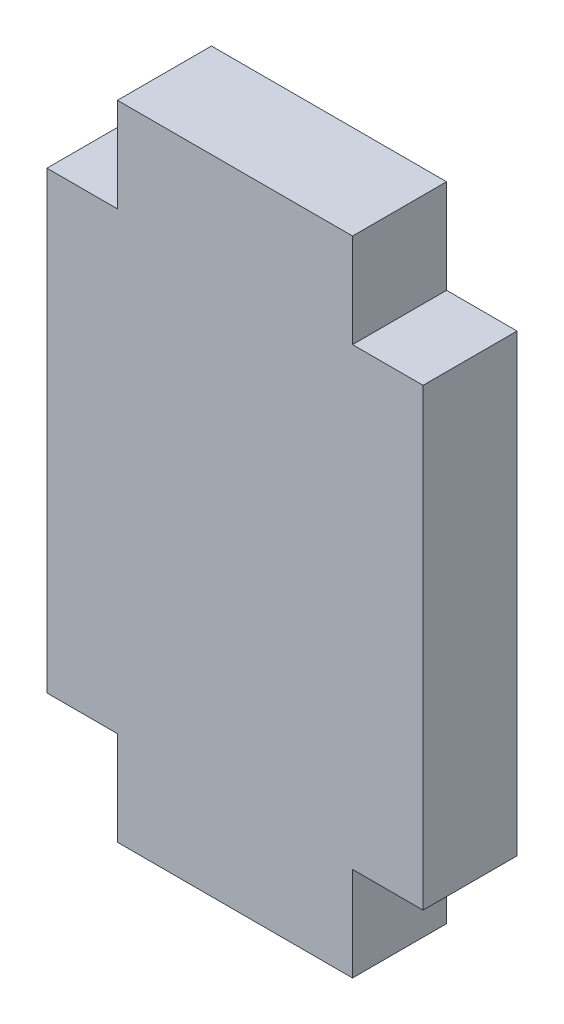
from build123d import *

# Parameters (mm, degrees)
BOSS_EXTRUDE1_DEPTH = 3


with BuildPart() as part:
    # Sketch1 → Boss-Extrude1 (new body)
    with BuildSketch(Plane.XY):
        Polygon((-17.481955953, 17.5), (-17.481955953, 14.5), (-19.731955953, 14.5), (-19.731955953, 0), (-17.481955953, 0), (-17.481955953, -3), (-9.981955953, -3), (-9.981955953, 0), (-7.731955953, 0), (-7.731955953, 14.5), (-9.981955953, 14.5), (-9.981955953, 17.5), align=None)
    extrude(amount=BOSS_EXTRUDE1_DEPTH)


solid = part.part
